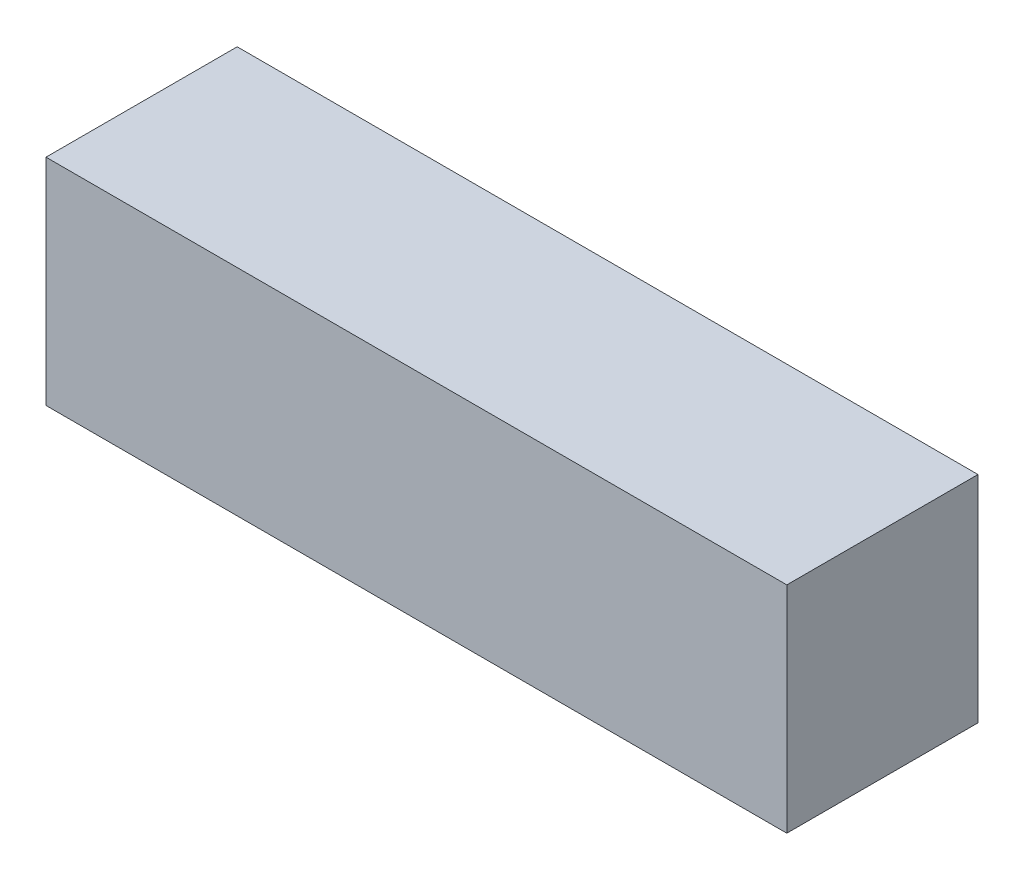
from build123d import *

# Parameters (mm, degrees)
ESQUISSE1_W      = 31
ESQUISSE1_H      = 9
EXTRUSION1_DEPTH = 8


with BuildPart() as part:
    # Esquisse1 → Extrusion1 (new body)
    with BuildSketch(Plane.XY):
        with Locations((15.5, 4.5)):
            Rectangle(ESQUISSE1_W, ESQUISSE1_H)
    extrude(amount=EXTRUSION1_DEPTH)


solid = part.part
